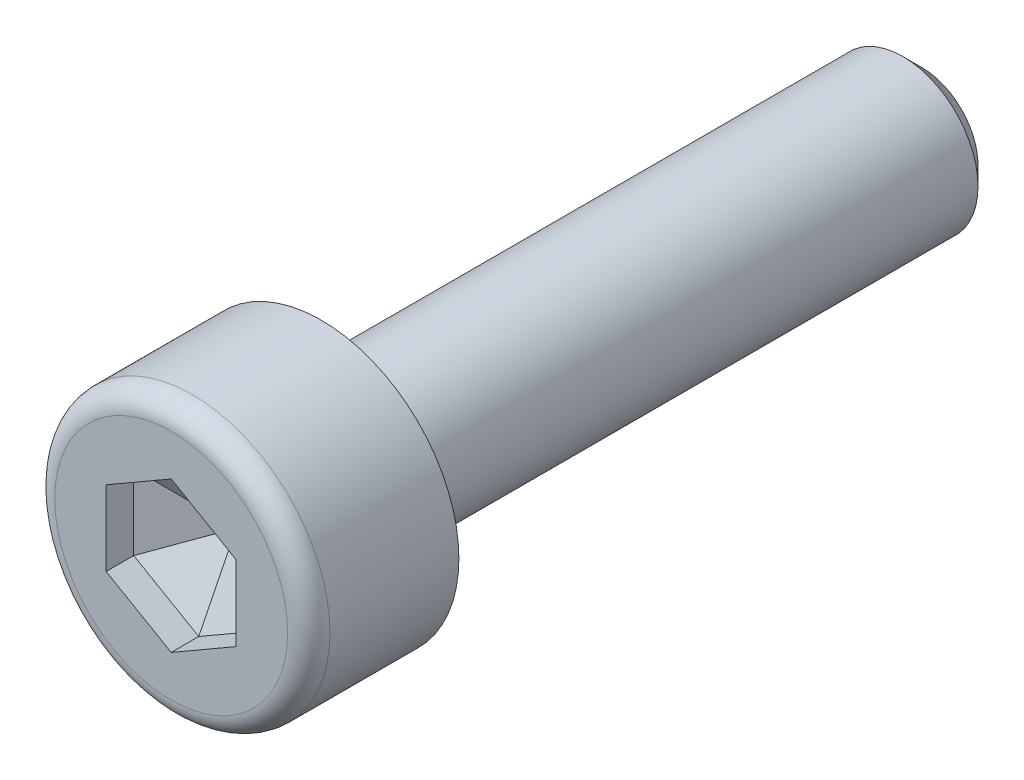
ISO-10303-21;
HEADER;
FILE_DESCRIPTION(('STEP AP214'),'2;1');
FILE_NAME('part.step','',(''),(''),'','','');
FILE_SCHEMA(('AUTOMOTIVE_DESIGN { 1 0 10303 214 1 1 1 1 }'));
ENDSEC;
DATA;
#1=APPLICATION_CONTEXT('core data for automotive mechanical design processes');
#2=APPLICATION_PROTOCOL_DEFINITION('international standard','automotive_design',2000,#1);
#3=PRODUCT_CONTEXT('',#1,'mechanical');
#4=PRODUCT('Part','Part','',(#3));
#5=PRODUCT_RELATED_PRODUCT_CATEGORY('part','',(#4));
#6=PRODUCT_DEFINITION_FORMATION('','',#4);
#7=PRODUCT_DEFINITION_CONTEXT('part definition',#1,'design');
#8=PRODUCT_DEFINITION('design','',#6,#7);
#9=PRODUCT_DEFINITION_SHAPE('','',#8);
#10=(LENGTH_UNIT() NAMED_UNIT(*) SI_UNIT(.MILLI.,.METRE.));
#11=(NAMED_UNIT(*) PLANE_ANGLE_UNIT() SI_UNIT($,.RADIAN.));
#12=(NAMED_UNIT(*) SI_UNIT($,.STERADIAN.) SOLID_ANGLE_UNIT());
#13=UNCERTAINTY_MEASURE_WITH_UNIT(LENGTH_MEASURE(1.E-05),#10,'distance_accuracy_value','');
#14=(GEOMETRIC_REPRESENTATION_CONTEXT(3) GLOBAL_UNCERTAINTY_ASSIGNED_CONTEXT((#13)) GLOBAL_UNIT_ASSIGNED_CONTEXT((#10,
#11,#12)) REPRESENTATION_CONTEXT('',''));
#15=CARTESIAN_POINT('',(0.,0.,0.));
#16=DIRECTION('',(0.,0.,1.));
#17=DIRECTION('',(1.,0.,0.));
#18=AXIS2_PLACEMENT_3D('',#15,#16,#17);
#19=CARTESIAN_POINT('',(0.,0.,0.));
#20=DIRECTION('',(0.,0.,1.));
#21=DIRECTION('',(1.,0.,0.));
#22=AXIS2_PLACEMENT_3D('',#19,#20,#21);
#23=PLANE('',#22);
#24=CARTESIAN_POINT('',(0.,0.,0.));
#25=DIRECTION('',(0.,0.,1.));
#26=DIRECTION('',(1.,0.,0.));
#27=AXIS2_PLACEMENT_3D('',#24,#25,#26);
#28=CIRCLE('',#27,1.6);
#29=CARTESIAN_POINT('',(1.6,0.,0.));
#30=VERTEX_POINT('',#29);
#31=EDGE_CURVE('E11',#30,#30,#28,.T.);
#32=ORIENTED_EDGE('',*,*,#31,.T.);
#33=EDGE_LOOP('',(#32));
#34=FACE_BOUND('',#33,.T.);
#35=CARTESIAN_POINT('',(0.,0.,0.));
#36=DIRECTION('',(0.,0.,1.));
#37=DIRECTION('',(1.,0.,0.));
#38=AXIS2_PLACEMENT_3D('',#35,#36,#37);
#39=CIRCLE('',#38,2.75);
#40=CARTESIAN_POINT('',(2.75,0.,0.));
#41=VERTEX_POINT('',#40);
#42=EDGE_CURVE('E171',#41,#41,#39,.T.);
#43=ORIENTED_EDGE('',*,*,#42,.F.);
#44=EDGE_LOOP('',(#43));
#45=FACE_BOUND('',#44,.T.);
#46=ADVANCED_FACE('F53',(#34,#45),#23,.F.);
#47=CARTESIAN_POINT('',(0.,0.,3.));
#48=DIRECTION('',(0.,0.,-1.));
#49=DIRECTION('',(-1.,0.,0.));
#50=AXIS2_PLACEMENT_3D('',#47,#48,#49);
#51=CYLINDRICAL_SURFACE('',#50,2.75);
#52=CARTESIAN_POINT('',(0.,0.,2.57692307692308));
#53=DIRECTION('',(0.,0.,1.));
#54=DIRECTION('',(1.,0.,0.));
#55=AXIS2_PLACEMENT_3D('',#52,#53,#54);
#56=CIRCLE('',#55,2.75);
#57=CARTESIAN_POINT('',(2.75,0.,2.57692307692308));
#58=VERTEX_POINT('',#57);
#59=EDGE_CURVE('E197',#58,#58,#56,.F.);
#60=ORIENTED_EDGE('',*,*,#59,.T.);
#61=EDGE_LOOP('',(#60));
#62=FACE_BOUND('',#61,.T.);
#63=ORIENTED_EDGE('',*,*,#42,.T.);
#64=EDGE_LOOP('',(#63));
#65=FACE_BOUND('',#64,.T.);
#66=ADVANCED_FACE('F276',(#62,#65),#51,.T.);
#67=CARTESIAN_POINT('',(0.,0.,3.));
#68=DIRECTION('',(0.,0.,1.));
#69=DIRECTION('',(1.,0.,0.));
#70=AXIS2_PLACEMENT_3D('',#67,#68,#69);
#71=PLANE('',#70);
#72=CARTESIAN_POINT('',(0.,0.,3.));
#73=DIRECTION('',(0.,0.,1.));
#74=DIRECTION('',(1.,0.,0.));
#75=AXIS2_PLACEMENT_3D('',#72,#73,#74);
#76=CIRCLE('',#75,2.32692307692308);
#77=CARTESIAN_POINT('',(2.32692307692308,0.,3.));
#78=VERTEX_POINT('',#77);
#79=EDGE_CURVE('E193',#78,#78,#76,.T.);
#80=ORIENTED_EDGE('',*,*,#79,.T.);
#81=EDGE_LOOP('',(#80));
#82=FACE_BOUND('',#81,.T.);
#83=DIRECTION('',(0.,1.,0.));
#84=VECTOR('',#83,1.);
#85=CARTESIAN_POINT('',(1.3,-0.750555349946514,3.));
#86=LINE('',#85,#84);
#87=CARTESIAN_POINT('',(1.3,-0.750555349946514,3.));
#88=VERTEX_POINT('',#87);
#89=CARTESIAN_POINT('',(1.3,0.750555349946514,3.));
#90=VERTEX_POINT('',#89);
#91=EDGE_CURVE('E148',#88,#90,#86,.T.);
#92=ORIENTED_EDGE('',*,*,#91,.F.);
#93=DIRECTION('',(0.866025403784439,0.5,0.));
#94=VECTOR('',#93,1.);
#95=CARTESIAN_POINT('',(0.,-1.50111069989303,3.));
#96=LINE('',#95,#94);
#97=CARTESIAN_POINT('',(0.,-1.50111069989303,3.));
#98=VERTEX_POINT('',#97);
#99=EDGE_CURVE('E164',#98,#88,#96,.T.);
#100=ORIENTED_EDGE('',*,*,#99,.F.);
#101=DIRECTION('',(0.866025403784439,-0.5,0.));
#102=VECTOR('',#101,1.);
#103=CARTESIAN_POINT('',(-1.3,-0.750555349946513,3.));
#104=LINE('',#103,#102);
#105=CARTESIAN_POINT('',(-1.3,-0.750555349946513,3.));
#106=VERTEX_POINT('',#105);
#107=EDGE_CURVE('E157',#106,#98,#104,.T.);
#108=ORIENTED_EDGE('',*,*,#107,.F.);
#109=DIRECTION('',(0.,-1.,0.));
#110=VECTOR('',#109,1.);
#111=CARTESIAN_POINT('',(-1.3,0.750555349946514,3.));
#112=LINE('',#111,#110);
#113=CARTESIAN_POINT('',(-1.3,0.750555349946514,3.));
#114=VERTEX_POINT('',#113);
#115=EDGE_CURVE('E153',#114,#106,#112,.T.);
#116=ORIENTED_EDGE('',*,*,#115,.F.);
#117=DIRECTION('',(-0.866025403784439,-0.5,0.));
#118=VECTOR('',#117,1.);
#119=CARTESIAN_POINT('',(0.,1.50111069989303,3.));
#120=LINE('',#119,#118);
#121=CARTESIAN_POINT('',(0.,1.50111069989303,3.));
#122=VERTEX_POINT('',#121);
#123=EDGE_CURVE('E131',#122,#114,#120,.T.);
#124=ORIENTED_EDGE('',*,*,#123,.F.);
#125=DIRECTION('',(-0.866025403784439,0.5,0.));
#126=VECTOR('',#125,1.);
#127=CARTESIAN_POINT('',(1.3,0.750555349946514,3.));
#128=LINE('',#127,#126);
#129=EDGE_CURVE('E142',#90,#122,#128,.T.);
#130=ORIENTED_EDGE('',*,*,#129,.F.);
#131=EDGE_LOOP('',(#92,#100,#108,#116,#124,#130));
#132=FACE_BOUND('',#131,.T.);
#133=ADVANCED_FACE('F150',(#82,#132),#71,.T.);
#134=CARTESIAN_POINT('',(1.3,-0.750555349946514,1.7));
#135=DIRECTION('',(1.,0.,0.));
#136=DIRECTION('',(0.,1.,0.));
#137=AXIS2_PLACEMENT_3D('',#134,#135,#136);
#138=PLANE('',#137);
#139=DIRECTION('',(0.,0.,1.));
#140=VECTOR('',#139,1.);
#141=CARTESIAN_POINT('',(1.3,0.750555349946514,1.7));
#142=LINE('',#141,#140);
#143=CARTESIAN_POINT('',(1.3,0.750555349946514,2.4492795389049));
#144=VERTEX_POINT('',#143);
#145=EDGE_CURVE('E139',#144,#90,#142,.T.);
#146=ORIENTED_EDGE('',*,*,#145,.F.);
#147=DIRECTION('',(0.,-1.,0.));
#148=VECTOR('',#147,1.);
#149=CARTESIAN_POINT('',(1.3,-0.750555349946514,2.4492795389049));
#150=LINE('',#149,#148);
#151=CARTESIAN_POINT('',(1.3,-0.750555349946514,2.4492795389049));
#152=VERTEX_POINT('',#151);
#153=EDGE_CURVE('E77',#144,#152,#150,.T.);
#154=ORIENTED_EDGE('',*,*,#153,.T.);
#155=DIRECTION('',(0.,0.,1.));
#156=VECTOR('',#155,1.);
#157=CARTESIAN_POINT('',(1.3,-0.750555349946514,1.7));
#158=LINE('',#157,#156);
#159=EDGE_CURVE('E168',#152,#88,#158,.T.);
#160=ORIENTED_EDGE('',*,*,#159,.T.);
#161=ORIENTED_EDGE('',*,*,#91,.T.);
#162=EDGE_LOOP('',(#146,#154,#160,#161));
#163=FACE_BOUND('',#162,.T.);
#164=ADVANCED_FACE('F336',(#163),#138,.F.);
#165=CARTESIAN_POINT('',(0.,-1.50111069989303,1.7));
#166=DIRECTION('',(0.5,-0.866025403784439,0.));
#167=DIRECTION('',(0.866025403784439,0.5,0.));
#168=AXIS2_PLACEMENT_3D('',#165,#166,#167);
#169=PLANE('',#168);
#170=ORIENTED_EDGE('',*,*,#159,.F.);
#171=DIRECTION('',(-0.866025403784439,-0.5,0.));
#172=VECTOR('',#171,1.);
#173=CARTESIAN_POINT('',(0.,-1.50111069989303,2.4492795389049));
#174=LINE('',#173,#172);
#175=CARTESIAN_POINT('',(0.,-1.50111069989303,2.4492795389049));
#176=VERTEX_POINT('',#175);
#177=EDGE_CURVE('E69',#152,#176,#174,.T.);
#178=ORIENTED_EDGE('',*,*,#177,.T.);
#179=DIRECTION('',(0.,0.,1.));
#180=VECTOR('',#179,1.);
#181=CARTESIAN_POINT('',(0.,-1.50111069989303,1.7));
#182=LINE('',#181,#180);
#183=EDGE_CURVE('E172',#176,#98,#182,.T.);
#184=ORIENTED_EDGE('',*,*,#183,.T.);
#185=ORIENTED_EDGE('',*,*,#99,.T.);
#186=EDGE_LOOP('',(#170,#178,#184,#185));
#187=FACE_BOUND('',#186,.T.);
#188=ADVANCED_FACE('F339',(#187),#169,.F.);
#189=CARTESIAN_POINT('',(-1.3,-0.750555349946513,1.7));
#190=DIRECTION('',(-0.5,-0.866025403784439,0.));
#191=DIRECTION('',(0.866025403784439,-0.5,0.));
#192=AXIS2_PLACEMENT_3D('',#189,#190,#191);
#193=PLANE('',#192);
#194=ORIENTED_EDGE('',*,*,#183,.F.);
#195=DIRECTION('',(-0.866025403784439,0.5,0.));
#196=VECTOR('',#195,1.);
#197=CARTESIAN_POINT('',(-1.3,-0.750555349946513,2.4492795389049));
#198=LINE('',#197,#196);
#199=CARTESIAN_POINT('',(-1.3,-0.750555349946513,2.4492795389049));
#200=VERTEX_POINT('',#199);
#201=EDGE_CURVE('E231',#176,#200,#198,.T.);
#202=ORIENTED_EDGE('',*,*,#201,.T.);
#203=DIRECTION('',(0.,0.,1.));
#204=VECTOR('',#203,1.);
#205=CARTESIAN_POINT('',(-1.3,-0.750555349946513,1.7));
#206=LINE('',#205,#204);
#207=EDGE_CURVE('E175',#200,#106,#206,.T.);
#208=ORIENTED_EDGE('',*,*,#207,.T.);
#209=ORIENTED_EDGE('',*,*,#107,.T.);
#210=EDGE_LOOP('',(#194,#202,#208,#209));
#211=FACE_BOUND('',#210,.T.);
#212=ADVANCED_FACE('F327',(#211),#193,.F.);
#213=CARTESIAN_POINT('',(-1.3,0.750555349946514,1.7));
#214=DIRECTION('',(-1.,0.,0.));
#215=DIRECTION('',(0.,0.,1.));
#216=AXIS2_PLACEMENT_3D('',#213,#214,#215);
#217=PLANE('',#216);
#218=ORIENTED_EDGE('',*,*,#207,.F.);
#219=DIRECTION('',(0.,1.,0.));
#220=VECTOR('',#219,1.);
#221=CARTESIAN_POINT('',(-1.3,0.750555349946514,2.4492795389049));
#222=LINE('',#221,#220);
#223=CARTESIAN_POINT('',(-1.3,0.750555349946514,2.4492795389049));
#224=VERTEX_POINT('',#223);
#225=EDGE_CURVE('E220',#200,#224,#222,.T.);
#226=ORIENTED_EDGE('',*,*,#225,.T.);
#227=DIRECTION('',(0.,0.,1.));
#228=VECTOR('',#227,1.);
#229=CARTESIAN_POINT('',(-1.3,0.750555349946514,1.7));
#230=LINE('',#229,#228);
#231=EDGE_CURVE('E138',#224,#114,#230,.T.);
#232=ORIENTED_EDGE('',*,*,#231,.T.);
#233=ORIENTED_EDGE('',*,*,#115,.T.);
#234=EDGE_LOOP('',(#218,#226,#232,#233));
#235=FACE_BOUND('',#234,.T.);
#236=ADVANCED_FACE('F330',(#235),#217,.F.);
#237=CARTESIAN_POINT('',(0.,1.50111069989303,1.7));
#238=DIRECTION('',(-0.5,0.866025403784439,0.));
#239=DIRECTION('',(-0.866025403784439,-0.5,0.));
#240=AXIS2_PLACEMENT_3D('',#237,#238,#239);
#241=PLANE('',#240);
#242=ORIENTED_EDGE('',*,*,#231,.F.);
#243=DIRECTION('',(0.866025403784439,0.5,0.));
#244=VECTOR('',#243,1.);
#245=CARTESIAN_POINT('',(0.,1.50111069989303,2.4492795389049));
#246=LINE('',#245,#244);
#247=CARTESIAN_POINT('',(0.,1.50111069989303,2.4492795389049));
#248=VERTEX_POINT('',#247);
#249=EDGE_CURVE('E134',#224,#248,#246,.T.);
#250=ORIENTED_EDGE('',*,*,#249,.T.);
#251=DIRECTION('',(0.,0.,1.));
#252=VECTOR('',#251,1.);
#253=CARTESIAN_POINT('',(0.,1.50111069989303,1.7));
#254=LINE('',#253,#252);
#255=EDGE_CURVE('E126',#248,#122,#254,.T.);
#256=ORIENTED_EDGE('',*,*,#255,.T.);
#257=ORIENTED_EDGE('',*,*,#123,.T.);
#258=EDGE_LOOP('',(#242,#250,#256,#257));
#259=FACE_BOUND('',#258,.T.);
#260=ADVANCED_FACE('F129',(#259),#241,.F.);
#261=CARTESIAN_POINT('',(1.3,0.750555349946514,1.7));
#262=DIRECTION('',(0.5,0.866025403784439,0.));
#263=DIRECTION('',(-0.866025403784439,0.5,0.));
#264=AXIS2_PLACEMENT_3D('',#261,#262,#263);
#265=PLANE('',#264);
#266=ORIENTED_EDGE('',*,*,#255,.F.);
#267=DIRECTION('',(0.866025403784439,-0.5,0.));
#268=VECTOR('',#267,1.);
#269=CARTESIAN_POINT('',(1.3,0.750555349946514,2.4492795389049));
#270=LINE('',#269,#268);
#271=EDGE_CURVE('E226',#248,#144,#270,.T.);
#272=ORIENTED_EDGE('',*,*,#271,.T.);
#273=ORIENTED_EDGE('',*,*,#145,.T.);
#274=ORIENTED_EDGE('',*,*,#129,.T.);
#275=EDGE_LOOP('',(#266,#272,#273,#274));
#276=FACE_BOUND('',#275,.T.);
#277=ADVANCED_FACE('F143',(#276),#265,.F.);
#278=CARTESIAN_POINT('',(0.,0.,1.7));
#279=DIRECTION('',(0.,0.,1.));
#280=DIRECTION('',(1.,0.,0.));
#281=AXIS2_PLACEMENT_3D('',#278,#279,#280);
#282=PLANE('',#281);
#283=DIRECTION('',(-0.866025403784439,-0.5,0.));
#284=VECTOR('',#283,1.);
#285=CARTESIAN_POINT('',(-0.00110488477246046,0.0019137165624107,1.7));
#286=LINE('',#285,#284);
#287=CARTESIAN_POINT('',(0.,0.00255162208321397,1.7));
#288=VERTEX_POINT('',#287);
#289=CARTESIAN_POINT('',(-0.00220976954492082,0.00127581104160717,1.7));
#290=VERTEX_POINT('',#289);
#291=EDGE_CURVE('E213',#288,#290,#286,.T.);
#292=ORIENTED_EDGE('',*,*,#291,.T.);
#293=DIRECTION('',(0.,-1.,0.));
#294=VECTOR('',#293,1.);
#295=CARTESIAN_POINT('',(-0.00220976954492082,0.,1.7));
#296=LINE('',#295,#294);
#297=CARTESIAN_POINT('',(-0.00220976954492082,-0.00127581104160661,1.7));
#298=VERTEX_POINT('',#297);
#299=EDGE_CURVE('E216',#290,#298,#296,.T.);
#300=ORIENTED_EDGE('',*,*,#299,.T.);
#301=DIRECTION('',(0.866025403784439,-0.5,0.));
#302=VECTOR('',#301,1.);
#303=CARTESIAN_POINT('',(-0.00110488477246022,-0.00191371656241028,1.7));
#304=LINE('',#303,#302);
#305=CARTESIAN_POINT('',(0.,-0.00255162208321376,1.7));
#306=VERTEX_POINT('',#305);
#307=EDGE_CURVE('E204',#298,#306,#304,.T.);
#308=ORIENTED_EDGE('',*,*,#307,.T.);
#309=DIRECTION('',(0.866025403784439,0.5,0.));
#310=VECTOR('',#309,1.);
#311=CARTESIAN_POINT('',(0.0011048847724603,-0.00191371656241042,1.7));
#312=LINE('',#311,#310);
#313=CARTESIAN_POINT('',(0.00220976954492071,-0.00127581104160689,1.7));
#314=VERTEX_POINT('',#313);
#315=EDGE_CURVE('E201',#306,#314,#312,.T.);
#316=ORIENTED_EDGE('',*,*,#315,.T.);
#317=DIRECTION('',(0.,1.,0.));
#318=VECTOR('',#317,1.);
#319=CARTESIAN_POINT('',(0.00220976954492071,0.,1.7));
#320=LINE('',#319,#318);
#321=CARTESIAN_POINT('',(0.00220976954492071,0.00127581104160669,1.7));
#322=VERTEX_POINT('',#321);
#323=EDGE_CURVE('E207',#314,#322,#320,.T.);
#324=ORIENTED_EDGE('',*,*,#323,.T.);
#325=DIRECTION('',(-0.866025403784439,0.5,0.));
#326=VECTOR('',#325,1.);
#327=CARTESIAN_POINT('',(0.00110488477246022,0.00191371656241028,1.7));
#328=LINE('',#327,#326);
#329=EDGE_CURVE('E210',#322,#288,#328,.T.);
#330=ORIENTED_EDGE('',*,*,#329,.T.);
#331=EDGE_LOOP('',(#292,#300,#308,#316,#324,#330));
#332=FACE_BOUND('',#331,.T.);
#333=ADVANCED_FACE('F348',(#332),#282,.T.);
#334=CARTESIAN_POINT('',(0.,0.,-12.));
#335=DIRECTION('',(0.,0.,1.));
#336=DIRECTION('',(1.,0.,0.));
#337=AXIS2_PLACEMENT_3D('',#334,#335,#336);
#338=CYLINDRICAL_SURFACE('',#337,1.5);
#339=CARTESIAN_POINT('',(0.,0.,-0.0999999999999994));
#340=DIRECTION('',(0.,0.,1.));
#341=DIRECTION('',(1.,0.,0.));
#342=AXIS2_PLACEMENT_3D('',#339,#340,#341);
#343=CIRCLE('',#342,1.5);
#344=CARTESIAN_POINT('',(1.5,0.,-0.0999999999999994));
#345=VERTEX_POINT('',#344);
#346=EDGE_CURVE('E62',#345,#345,#343,.F.);
#347=ORIENTED_EDGE('',*,*,#346,.T.);
#348=EDGE_LOOP('',(#347));
#349=FACE_BOUND('',#348,.T.);
#350=CARTESIAN_POINT('',(0.,0.,-11.625));
#351=DIRECTION('',(0.,0.,-1.));
#352=DIRECTION('',(-1.,0.,0.));
#353=AXIS2_PLACEMENT_3D('',#350,#351,#352);
#354=CIRCLE('',#353,1.5);
#355=CARTESIAN_POINT('',(-1.5,0.,-11.625));
#356=VERTEX_POINT('',#355);
#357=EDGE_CURVE('E189',#356,#356,#354,.F.);
#358=ORIENTED_EDGE('',*,*,#357,.T.);
#359=EDGE_LOOP('',(#358));
#360=FACE_BOUND('',#359,.T.);
#361=ADVANCED_FACE('F261',(#349,#360),#338,.T.);
#362=CARTESIAN_POINT('',(0.,0.,-12.));
#363=DIRECTION('',(0.,0.,-1.));
#364=DIRECTION('',(-1.,0.,0.));
#365=AXIS2_PLACEMENT_3D('',#362,#363,#364);
#366=PLANE('',#365);
#367=CARTESIAN_POINT('',(0.,0.,-12.));
#368=DIRECTION('',(0.,0.,-1.));
#369=DIRECTION('',(-1.,0.,0.));
#370=AXIS2_PLACEMENT_3D('',#367,#368,#369);
#371=CIRCLE('',#370,1.125);
#372=CARTESIAN_POINT('',(-1.125,0.,-12.));
#373=VERTEX_POINT('',#372);
#374=EDGE_CURVE('E185',#373,#373,#371,.T.);
#375=ORIENTED_EDGE('',*,*,#374,.T.);
#376=EDGE_LOOP('',(#375));
#377=FACE_BOUND('',#376,.T.);
#378=ADVANCED_FACE('F292',(#377),#366,.T.);
#379=CARTESIAN_POINT('',(0.,0.,-12.));
#380=DIRECTION('',(0.,0.,1.));
#381=DIRECTION('',(1.,0.,0.));
#382=AXIS2_PLACEMENT_3D('',#379,#380,#381);
#383=CONICAL_SURFACE('',#382,1.125,0.785398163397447);
#384=ORIENTED_EDGE('',*,*,#357,.F.);
#385=EDGE_LOOP('',(#384));
#386=FACE_BOUND('',#385,.T.);
#387=ORIENTED_EDGE('',*,*,#374,.F.);
#388=EDGE_LOOP('',(#387));
#389=FACE_BOUND('',#388,.T.);
#390=ADVANCED_FACE('F288',(#386,#389),#383,.T.);
#391=CARTESIAN_POINT('',(0.,0.,2.57692307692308));
#392=DIRECTION('',(0.,0.,1.));
#393=DIRECTION('',(1.,0.,0.));
#394=AXIS2_PLACEMENT_3D('',#391,#392,#393);
#395=TOROIDAL_SURFACE('',#394,2.32692307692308,0.423076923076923);
#396=ORIENTED_EDGE('',*,*,#59,.F.);
#397=EDGE_LOOP('',(#396));
#398=FACE_BOUND('',#397,.T.);
#399=ORIENTED_EDGE('',*,*,#79,.F.);
#400=EDGE_LOOP('',(#399));
#401=FACE_BOUND('',#400,.T.);
#402=ADVANCED_FACE('F291',(#398,#401),#395,.T.);
#403=CARTESIAN_POINT('',(0.00220976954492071,0.,1.7));
#404=DIRECTION('',(0.499999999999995,0.,-0.866025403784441));
#405=DIRECTION('',(0.,1.,0.));
#406=AXIS2_PLACEMENT_3D('',#403,#404,#405);
#407=PLANE('',#406);
#408=DIRECTION('',(-0.774596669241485,0.447213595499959,-0.447213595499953));
#409=VECTOR('',#408,1.);
#410=CARTESIAN_POINT('',(0.00176781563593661,-0.00102064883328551,1.69974483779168));
#411=LINE('',#410,#409);
#412=EDGE_CURVE('E250',#152,#314,#411,.T.);
#413=ORIENTED_EDGE('',*,*,#412,.F.);
#414=ORIENTED_EDGE('',*,*,#153,.F.);
#415=DIRECTION('',(-0.774596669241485,-0.447213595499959,-0.447213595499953));
#416=VECTOR('',#415,1.);
#417=CARTESIAN_POINT('',(0.00176781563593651,0.00102064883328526,1.69974483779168));
#418=LINE('',#417,#416);
#419=EDGE_CURVE('E254',#322,#144,#418,.F.);
#420=ORIENTED_EDGE('',*,*,#419,.F.);
#421=ORIENTED_EDGE('',*,*,#323,.F.);
#422=EDGE_LOOP('',(#413,#414,#420,#421));
#423=FACE_BOUND('',#422,.T.);
#424=ADVANCED_FACE('F295',(#423),#407,.F.);
#425=CARTESIAN_POINT('',(0.00110488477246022,0.00191371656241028,1.7));
#426=DIRECTION('',(0.249999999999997,0.433012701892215,-0.866025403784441));
#427=DIRECTION('',(-0.866025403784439,0.5,0.));
#428=AXIS2_PLACEMENT_3D('',#425,#426,#427);
#429=PLANE('',#428);
#430=ORIENTED_EDGE('',*,*,#419,.T.);
#431=ORIENTED_EDGE('',*,*,#271,.F.);
#432=DIRECTION('',(0.,-0.894427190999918,-0.447213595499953));
#433=VECTOR('',#432,1.);
#434=CARTESIAN_POINT('',(0.,0.00204129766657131,1.69974483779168));
#435=LINE('',#434,#433);
#436=EDGE_CURVE('E246',#288,#248,#435,.F.);
#437=ORIENTED_EDGE('',*,*,#436,.F.);
#438=ORIENTED_EDGE('',*,*,#329,.F.);
#439=EDGE_LOOP('',(#430,#431,#437,#438));
#440=FACE_BOUND('',#439,.T.);
#441=ADVANCED_FACE('F308',(#440),#429,.F.);
#442=CARTESIAN_POINT('',(0.0011048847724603,-0.00191371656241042,1.7));
#443=DIRECTION('',(0.249999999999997,-0.433012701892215,-0.866025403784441));
#444=DIRECTION('',(0.866025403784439,0.5,0.));
#445=AXIS2_PLACEMENT_3D('',#442,#443,#444);
#446=PLANE('',#445);
#447=ORIENTED_EDGE('',*,*,#412,.T.);
#448=ORIENTED_EDGE('',*,*,#315,.F.);
#449=DIRECTION('',(0.,-0.894427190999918,0.447213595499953));
#450=VECTOR('',#449,1.);
#451=CARTESIAN_POINT('',(0.,-0.00204129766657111,1.69974483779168));
#452=LINE('',#451,#450);
#453=EDGE_CURVE('E242',#176,#306,#452,.F.);
#454=ORIENTED_EDGE('',*,*,#453,.F.);
#455=ORIENTED_EDGE('',*,*,#177,.F.);
#456=EDGE_LOOP('',(#447,#448,#454,#455));
#457=FACE_BOUND('',#456,.T.);
#458=ADVANCED_FACE('F304',(#457),#446,.F.);
#459=CARTESIAN_POINT('',(-0.00110488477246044,0.00191371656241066,1.7));
#460=DIRECTION('',(-0.249999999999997,0.433012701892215,-0.866025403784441));
#461=DIRECTION('',(-0.866025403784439,-0.5,0.));
#462=AXIS2_PLACEMENT_3D('',#459,#460,#461);
#463=PLANE('',#462);
#464=ORIENTED_EDGE('',*,*,#436,.T.);
#465=ORIENTED_EDGE('',*,*,#249,.F.);
#466=DIRECTION('',(0.774596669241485,-0.447213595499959,-0.447213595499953));
#467=VECTOR('',#466,1.);
#468=CARTESIAN_POINT('',(-0.00176781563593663,0.00102064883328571,1.69974483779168));
#469=LINE('',#468,#467);
#470=EDGE_CURVE('E239',#290,#224,#469,.F.);
#471=ORIENTED_EDGE('',*,*,#470,.F.);
#472=ORIENTED_EDGE('',*,*,#291,.F.);
#473=EDGE_LOOP('',(#464,#465,#471,#472));
#474=FACE_BOUND('',#473,.T.);
#475=ADVANCED_FACE('F300',(#474),#463,.F.);
#476=CARTESIAN_POINT('',(-0.0011048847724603,-0.00191371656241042,1.7));
#477=DIRECTION('',(-0.249999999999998,-0.433012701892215,-0.866025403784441));
#478=DIRECTION('',(0.866025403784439,-0.5,0.));
#479=AXIS2_PLACEMENT_3D('',#476,#477,#478);
#480=PLANE('',#479);
#481=ORIENTED_EDGE('',*,*,#453,.T.);
#482=ORIENTED_EDGE('',*,*,#307,.F.);
#483=DIRECTION('',(-0.774596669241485,-0.447213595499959,0.447213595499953));
#484=VECTOR('',#483,1.);
#485=CARTESIAN_POINT('',(-0.00176781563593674,-0.00102064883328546,1.69974483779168));
#486=LINE('',#485,#484);
#487=EDGE_CURVE('E236',#200,#298,#486,.F.);
#488=ORIENTED_EDGE('',*,*,#487,.F.);
#489=ORIENTED_EDGE('',*,*,#201,.F.);
#490=EDGE_LOOP('',(#481,#482,#488,#489));
#491=FACE_BOUND('',#490,.T.);
#492=ADVANCED_FACE('F271',(#491),#480,.F.);
#493=CARTESIAN_POINT('',(-0.00220976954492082,0.,1.7));
#494=DIRECTION('',(-0.499999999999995,0.,-0.866025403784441));
#495=DIRECTION('',(0.,-1.,0.));
#496=AXIS2_PLACEMENT_3D('',#493,#494,#495);
#497=PLANE('',#496);
#498=ORIENTED_EDGE('',*,*,#470,.T.);
#499=ORIENTED_EDGE('',*,*,#225,.F.);
#500=ORIENTED_EDGE('',*,*,#487,.T.);
#501=ORIENTED_EDGE('',*,*,#299,.F.);
#502=EDGE_LOOP('',(#498,#499,#500,#501));
#503=FACE_BOUND('',#502,.T.);
#504=ADVANCED_FACE('F265',(#503),#497,.F.);
#505=CARTESIAN_POINT('',(0.,0.,-0.0999999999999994));
#506=DIRECTION('',(0.,0.,1.));
#507=DIRECTION('',(1.,0.,0.));
#508=AXIS2_PLACEMENT_3D('',#505,#506,#507);
#509=TOROIDAL_SURFACE('',#508,1.6,0.1);
#510=ORIENTED_EDGE('',*,*,#31,.F.);
#511=EDGE_LOOP('',(#510));
#512=FACE_BOUND('',#511,.T.);
#513=ORIENTED_EDGE('',*,*,#346,.F.);
#514=EDGE_LOOP('',(#513));
#515=FACE_BOUND('',#514,.T.);
#516=ADVANCED_FACE('F55',(#512,#515),#509,.F.);
#517=CLOSED_SHELL('',(#46,#66,#133,#164,#188,#212,#236,#260,#277,#333,#361,#378,#390,#402,#424,
#441,#458,#475,#492,#504,#516));
#518=MANIFOLD_SOLID_BREP('B2',#517);
#519=ADVANCED_BREP_SHAPE_REPRESENTATION('',(#18,#518),#14);
#520=SHAPE_DEFINITION_REPRESENTATION(#9,#519);
ENDSEC;
END-ISO-10303-21;
